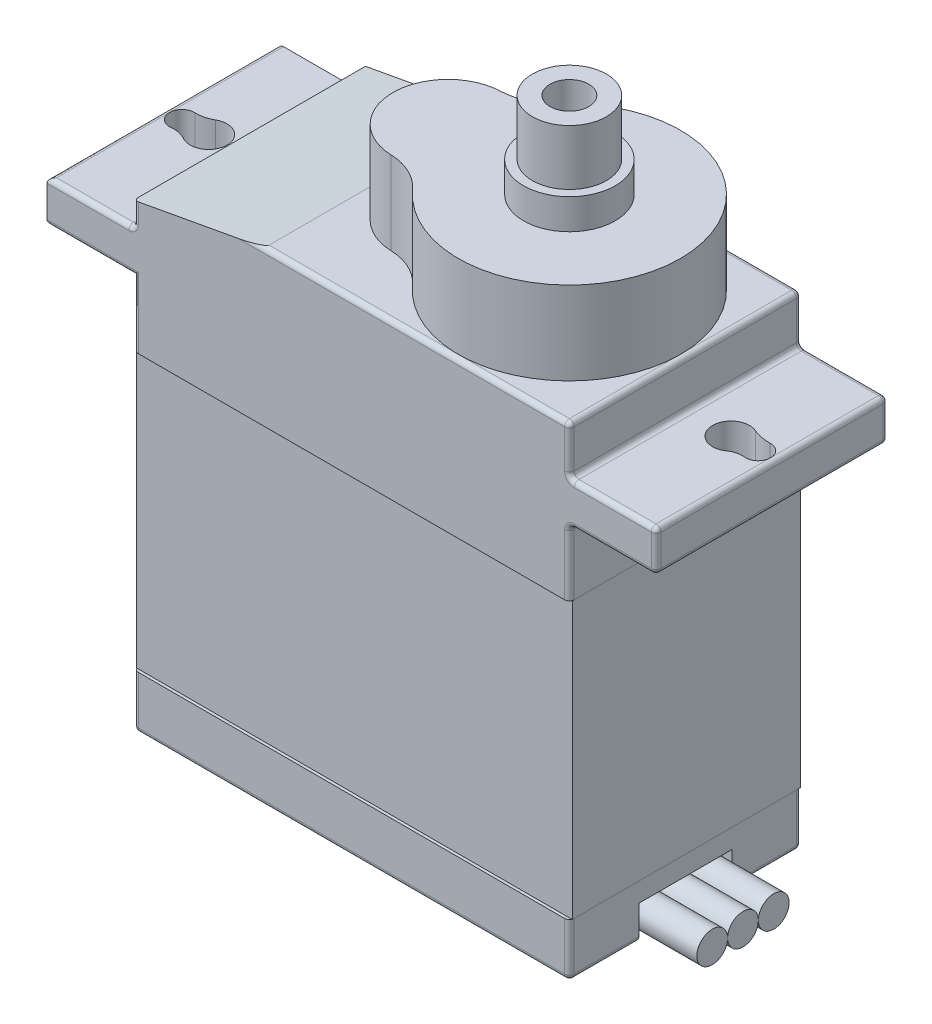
from build123d import *

# Parameters (mm, degrees)
CROQUIS1_W                   = 22.67
CROQUIS1_H                   = 12.06
SALIENTE_EXTRUIR1_DEPTH      = 25.15
CROQUIS2_W                   = 12.06
CROQUIS2_H                   = 2.13
SALIENTE_EXTRUIR2_DEPTH      = 4.51
CROQUIS5_W                   = 12.06
CROQUIS5_H                   = 2.13
SALIENTE_EXTRUIR3_DEPTH      = 4.51
REDONDEO1_R                  = 0.25
CORTAR_EXTRUIR12_DEPTH       = 4.51
SALIENTE_EXTRUIR4_DEPTH      = 4.32
CROQUIS9_R                   = 2.385
SALIENTE_EXTRUIR5_DEPTH      = 1.58
CROQUIS10_R                  = 2.385
SALIENTE_EXTRUIR6_DEPTH      = 2.88
CROQUIS11_R                  = 1.01
CORTAR_EXTRUIR13_DEPTH       = 3.88
CROQUIS12_R                  = 2.385
CROQUIS12_R_2                = 1.925
CORTAR_EXTRUIR14_DEPTH       = 2.88
CORTAR_EXTRUIR15_DEPTH       = 16.88
CROQUIS14_W                  = 22.17
CROQUIS14_H                  = 14.33
CORTAR_EXTRUIR16_DEPTH       = 16.88
CROQUIS16_W                  = 11.56
CROQUIS16_H                  = 14.354716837
CORTAR_EXTRUIR17_DEPTH       = 27.88
CORTAR_EXTRUIR18_DEPTH       = 27.88
CORTAR_EXTRUIR18_DEPTH_BACK  = 27.88
CROQUIS17_W                  = 22.67
CROQUIS17_H                  = 14.354716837
SALIENTE_EXTRUIR7_DEPTH      = 5.88
SALIENTE_EXTRUIR7_DEPTH_BACK = 6
CROQUIS18_W                  = 22.67
CROQUIS18_H                  = 14.354716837
CROQUIS19_W                  = 4.84
CROQUIS19_H                  = 1.754840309
CORTAR_EXTRUIR19_DEPTH       = 1.6
CROQUIS20_R                  = 0.8
SALIENTE_EXTRUIR8_DEPTH      = 4.6
SALIENTE_EXTRUIR8_2_DEPTH    = 4.6
SALIENTE_EXTRUIR8_3_DEPTH    = 4.6


with BuildPart() as part:
    # Croquis1 → Saliente-Extruir1 (new body)
    with BuildSketch(Plane(origin=(0, 0, 0), x_dir=(1, 0, 0), z_dir=(0, 1, 0))):
        Rectangle(CROQUIS1_W, CROQUIS1_H)
    extrude(amount=SALIENTE_EXTRUIR1_DEPTH)

    # Croquis2 → Saliente-Extruir2 (add)
    with BuildSketch(Plane(origin=(11.335, 0, 0), x_dir=(0, 0, -1), z_dir=(1, 0, 0))):
        with Locations((0, 21.595)):
            Rectangle(CROQUIS2_W, CROQUIS2_H)
    extrude(amount=SALIENTE_EXTRUIR2_DEPTH)

    # Croquis5 → Saliente-Extruir3 (add)
    with BuildSketch(Plane.ZY.offset(11.335)):
        with Locations((0, 21.595)):
            Rectangle(CROQUIS5_W, CROQUIS5_H)
    extrude(amount=SALIENTE_EXTRUIR3_DEPTH)

    # Redondeo1
    redondeo1_edges = [part.edges().sort_by_distance(p)[0] for p in [
        (-11.335, 23.905, 6.03),
        (11.335, 10.265, 6.03),
        (11.335, 23.905, 6.03),
        (11.335, 23.905, -6.03),
        (11.335, 10.265, -6.03),
        (11.335, 0, 0),
        (0, 0, -6.03),
        (0, 0, 6.03),
        (-11.335, 0, 0),
        (-11.335, 10.265, -6.03),
        (-11.335, 10.265, 6.03),
        (-13.59, 20.53, 6.03),
        (-13.59, 22.66, 6.03),
        (0, 25.15, -6.03),
        (0, 25.15, 6.03),
        (-11.335, 22.66, 0),
        (-11.335, 25.15, 0),
        (11.335, 25.15, 0),
        (13.59, 20.53, 6.03),
        (13.59, 22.66, 6.03),
        (13.59, 22.66, -6.03),
        (13.59, 20.53, -6.03),
        (11.335, 20.53, 0),
        (11.335, 22.66, 0),
        (15.845, 21.595, -6.03),
        (15.845, 21.595, 6.03),
        (15.845, 20.53, 0),
        (15.845, 22.66, 0),
        (-15.845, 20.53, 0),
        (-15.845, 22.66, 0),
    ]]
    fillet(redondeo1_edges, radius=REDONDEO1_R)

    # Croquis6 → Cortar-Extruir12 (cut)
    with BuildSketch(Plane(origin=(0, 22.66, 0), x_dir=(1, 0, 0), z_dir=(0, 1, 0))):
        with BuildLine():
            ThreePointArc((-14.075367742, -0.703262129), (-12.630008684, 0.120916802), (-14.068304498, 0.957360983))
            ThreePointArc((-14.068304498, 0.957360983), (-14.480150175, 0.792305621), (-14.921605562, 0.74783906))
            ThreePointArc((-14.921605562, 0.74783906), (-15.594396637, 0.072910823), (-14.865906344, -0.541481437))
            ThreePointArc((-14.865906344, -0.541481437), (-14.457242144, -0.556917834), (-14.075367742, -0.703262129))
        make_face()
        with BuildLine():
            ThreePointArc((14.149252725, -0.655279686), (12.635645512, 0.021040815), (13.968135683, 1.007390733))
            ThreePointArc((13.968135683, 1.007390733), (14.44022027, 0.862504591), (14.932312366, 0.821258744))
            ThreePointArc((14.932312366, 0.821258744), (15.594285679, 0.14353072), (14.871650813, -0.469105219))
            ThreePointArc((14.871650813, -0.469105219), (14.493048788, -0.494665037), (14.149252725, -0.655279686))
        make_face()
    extrude(amount=-CORTAR_EXTRUIR12_DEPTH, mode=Mode.SUBTRACT)

    # Croquis13 → Cortar-Extruir15 (cut)
    with BuildSketch(Plane.XY.offset(6.03)):
        Polygon((-4.540532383, 25.15), (-11.335, 23.905), (-11.335, 25.15), align=None)
    extrude(amount=-CORTAR_EXTRUIR15_DEPTH, mode=Mode.SUBTRACT)

    # Croquis14 → Cortar-Extruir16 (cut)
    with BuildSketch(Plane.XY.offset(6.03)):
        with Locations((0, 9.935)):
            Rectangle(CROQUIS14_W, CROQUIS14_H)
    extrude(amount=-CORTAR_EXTRUIR16_DEPTH, mode=Mode.SUBTRACT)

    # Croquis16 → Cortar-Extruir17 (cut)
    with BuildSketch(Plane.ZY.offset(11.335)):
        with Locations((0, 9.932198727)):
            Rectangle(CROQUIS16_W, CROQUIS16_H)
    extrude(amount=-CORTAR_EXTRUIR17_DEPTH, mode=Mode.SUBTRACT)

    # Croquis17 → Cortar-Extruir18 (cut, two sides: drawn at the far end of the back side and taken through both)
    with BuildSketch(Plane.XY.offset(-CORTAR_EXTRUIR18_DEPTH_BACK)):
        with Locations((0, 9.932198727)):
            Rectangle(CROQUIS17_W, CROQUIS17_H)
    extrude(amount=CORTAR_EXTRUIR18_DEPTH + CORTAR_EXTRUIR18_DEPTH_BACK, mode=Mode.SUBTRACT)


with BuildPart() as body_2:
    # Croquis8 → Saliente-Extruir4 (new body)
    with BuildSketch(Plane(origin=(0, 25.15, 0), x_dir=(1, 0, 0), z_dir=(0, 1, 0))):
        with BuildLine():
            ThreePointArc((0.994686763, -3.850921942), (11.085, 0), (0.994686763, 3.850921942))
            ThreePointArc((0.994686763, 3.850921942), (0.038958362, 3.138827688), (-1.119352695, 2.85809561))
            ThreePointArc((-1.119352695, 2.85809561), (-3.875, 0), (-1.119352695, -2.85809561))
            ThreePointArc((-1.119352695, -2.85809561), (0.038958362, -3.138827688), (0.994686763, -3.850921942))
        make_face()
    extrude(amount=SALIENTE_EXTRUIR4_DEPTH)


with BuildPart() as body_3:
    # Croquis9 → Saliente-Extruir5 (new body)
    with BuildSketch(Plane(origin=(0, 29.47, 0), x_dir=(1, 0, 0), z_dir=(0, 1, 0))):
        with Locations(Location((5.305, 0, 0), (0, 0, 90))):
            Circle(CROQUIS9_R)
    extrude(amount=SALIENTE_EXTRUIR5_DEPTH)


with BuildPart() as body_4:
    # Croquis10 → Saliente-Extruir6 (new body)
    with BuildSketch(Plane(origin=(0, 31.05, 0), x_dir=(1, 0, 0), z_dir=(0, 1, 0))):
        with Locations(Location((5.305, 0, 0), (0, 0, 90))):
            Circle(CROQUIS10_R)
    extrude(amount=SALIENTE_EXTRUIR6_DEPTH)


with BuildPart() as cortar_extruir13_tool:
    # Croquis11 → Cortar-Extruir13 (new body)
    with BuildSketch(Plane(origin=(0, 33.93, 0), x_dir=(1, 0, 0), z_dir=(0, 1, 0))):
        with Locations(Location((5.305, 0, 0), (0, 0, 270))):
            Circle(CROQUIS11_R)
    extrude(amount=-CORTAR_EXTRUIR13_DEPTH)


with BuildPart() as body_3_1:
    add(body_3.part)

    # Cortar-Extruir13: cut by cortar_extruir13_tool
    add(cortar_extruir13_tool.part, mode=Mode.SUBTRACT)


with BuildPart() as body_4_1:
    add(body_4.part)

    # Cortar-Extruir13: cut by cortar_extruir13_tool
    add(cortar_extruir13_tool.part, mode=Mode.SUBTRACT)

    # Croquis12 → Cortar-Extruir14 (cut)
    with BuildSketch(Plane(origin=(0, 33.93, 0), x_dir=(1, 0, 0), z_dir=(0, 1, 0))):
        with Locations(Location((5.305, 0, 0), (0, 0, 90))):
            Circle(CROQUIS12_R)
        with Locations(Location((5.305, 0, 0), (0, 0, 270))):
            Circle(CROQUIS12_R_2, mode=Mode.SUBTRACT)
    extrude(amount=-CORTAR_EXTRUIR14_DEPTH, mode=Mode.SUBTRACT)


with BuildPart() as cortar_extruir18_piece_1:
    # of the separate pieces the step leaves, piece 1, a body of its own (cortar_extruir18_pieces)
    add(part.part.solids().sort_by_distance((-11.085, 17.109557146, -6.03))[0])


with BuildPart() as cortar_extruir18_piece_2:
    # of the separate pieces the step leaves, piece 2, a body of its own (cortar_extruir18_pieces)
    add(part.part.solids().sort_by_distance((11.085, 0.25, -6.03))[0])

    # Croquis19 → Cortar-Extruir19 (cut)
    with BuildSketch(Plane(origin=(11.335, 0, 0), x_dir=(0, 0, -1), z_dir=(1, 0, 0))):
        with Locations((0, 0.877420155)):
            Rectangle(CROQUIS19_W, CROQUIS19_H)
    extrude(amount=-CORTAR_EXTRUIR19_DEPTH, mode=Mode.SUBTRACT)


with BuildPart() as body_6:
    # Croquis18 → Saliente-Extruir7 (new, two sides: drawn at the far end of the back side and taken through both)
    with BuildSketch(Plane.XY.offset(-SALIENTE_EXTRUIR7_DEPTH_BACK)):
        with Locations((0, 9.932198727)):
            Rectangle(CROQUIS18_W, CROQUIS18_H)
    extrude(amount=SALIENTE_EXTRUIR7_DEPTH + SALIENTE_EXTRUIR7_DEPTH_BACK)


with BuildPart() as body_7:
    # Croquis20 → Saliente-Extruir8 (new body)
    with BuildSketch(Plane(origin=(9.735, 0, 0), x_dir=(0, 0, -1), z_dir=(1, 0, 0))):
        with Locations((-1.6, 0.877420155)):
            Circle(CROQUIS20_R)
    extrude(amount=SALIENTE_EXTRUIR8_DEPTH)


with BuildPart() as body_8:
    # Croquis20 → Saliente-Extruir8 2 (new body)
    with BuildSketch(Plane(origin=(9.735, 0, 0), x_dir=(0, 0, -1), z_dir=(1, 0, 0))):
        with Locations((0, 0.877420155)):
            Circle(CROQUIS20_R)
    extrude(amount=SALIENTE_EXTRUIR8_2_DEPTH)


with BuildPart() as body_9:
    # Croquis20 → Saliente-Extruir8 3 (new body)
    with BuildSketch(Plane(origin=(9.735, 0, 0), x_dir=(0, 0, -1), z_dir=(1, 0, 0))):
        with Locations((1.6, 0.877420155)):
            Circle(CROQUIS20_R)
    extrude(amount=SALIENTE_EXTRUIR8_3_DEPTH)


solid = Compound([body_2.part, body_3_1.part, body_4_1.part, cortar_extruir18_piece_1.part, cortar_extruir18_piece_2.part, body_6.part, body_7.part, body_8.part, body_9.part])
